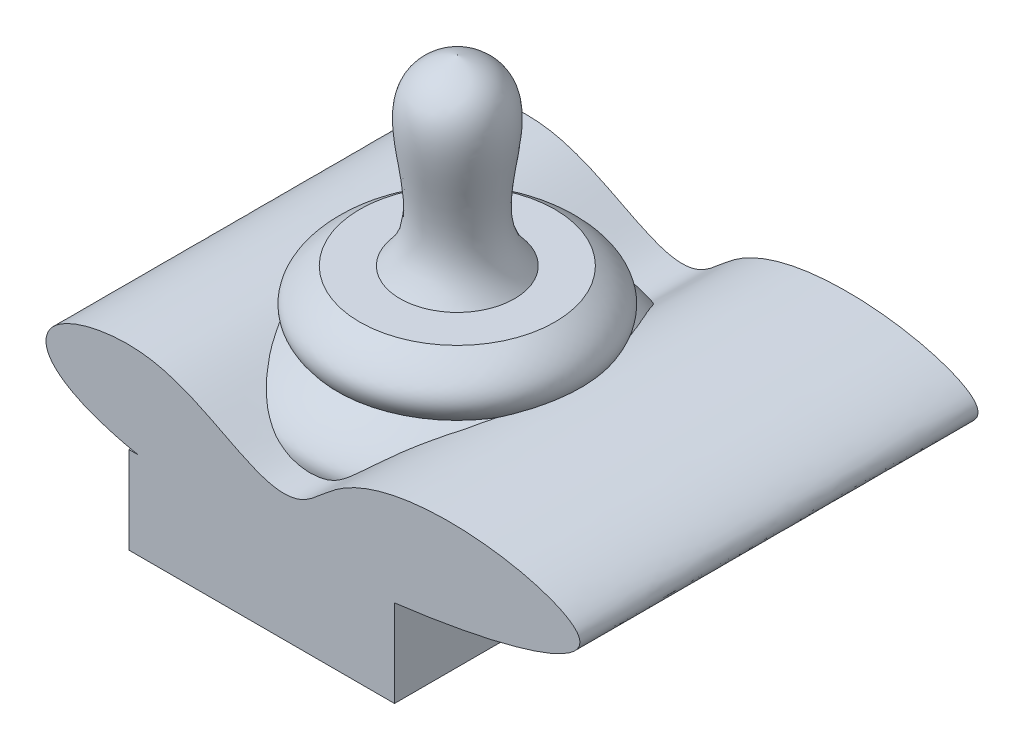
from build123d import *

# Parameters (mm, degrees)
BOSS_EXTRUDE2_DEPTH      = 60.96
BOSS_EXTRUDE2_DEPTH_BACK = 68.58


with BuildPart() as part:
    # Sketch1 → Revolve1 (revolve)
    with BuildSketch(Plane.XY):
        with BuildLine():
            Line((0, 0), (31.766049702, 0))
            add(Edge.make_bspline(
                [(31.766049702, 0), (55.0698737, -14.239924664), (21.575259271, -21.939659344), (12.861420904, -50.530400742), (21.573132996, -74.242271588), (0, -54.388568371)],
                knots=[0, 0, 0, 0, 0.481937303, 0.627514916, 1, 1, 1, 1], degree=3))
            Line((0, -54.388568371), (0, 0))
        make_face()
    revolve(axis=Axis((0, 0, 0), (0, -1, 0)))

    # Sketch2 → Revolve2 (revolve)
    with BuildSketch(Plane.XY):
        with BuildLine():
            Line((0, -46.539251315), (27.737331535, -46.539251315))
            add(Edge.make_bspline(
                [(27.737331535, -46.539251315), (83.940611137, -25.50908095), (-21.06122617, -11.136154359), (27.622861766, 52.690376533), (0, 59.309487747)],
                knots=[0, 0, 0, 0, 0.579051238, 1, 1, 1, 1], degree=3))
            Line((0, 59.309487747), (0, -46.539251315))
        make_face()
    revolve(axis=Axis((0, -46.539251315, 0), (0, 1, 0)))


with BuildPart() as body_2:
    # Sketch4 → Boss-Extrude2 (new, two sides: drawn at the far end of the back side and taken through both)
    with BuildSketch(Plane.XY.offset(-BOSS_EXTRUDE2_DEPTH_BACK)):
        with BuildLine():
            Line((-42.83456763, -44.254436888), (-45.857688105, -44.254436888))
            Line((-45.857688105, -44.254436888), (-45.857688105, -72.616347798))
            Line((-45.857688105, -72.616347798), (40.524856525, -72.616347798))
            Line((40.524856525, -72.616347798), (40.524856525, -44.254436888))
            add(Edge.make_bspline(
                [(-42.83456763, -44.254436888), (-60.689164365, -40.762586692), (-76.389572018, -32.699003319), (-69.151525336, -17.635713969), (-27.424117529, -7.625541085), (1.997393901, -41.824177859), (36.744481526, -3.708431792), (138.302604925, -22.106306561), (76.224267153, -39.779337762), (40.524856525, -44.254436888)],
                knots=[0, 0, 0, 0, 0.119188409, 0.141970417, 0.227820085, 0.379371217, 0.416905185, 0.640858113, 0.842324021, 0.842324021, 0.842324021, 0.842324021], degree=3))
        make_face()
    extrude(amount=BOSS_EXTRUDE2_DEPTH + BOSS_EXTRUDE2_DEPTH_BACK)


solid = Compound([part.part, body_2.part])
